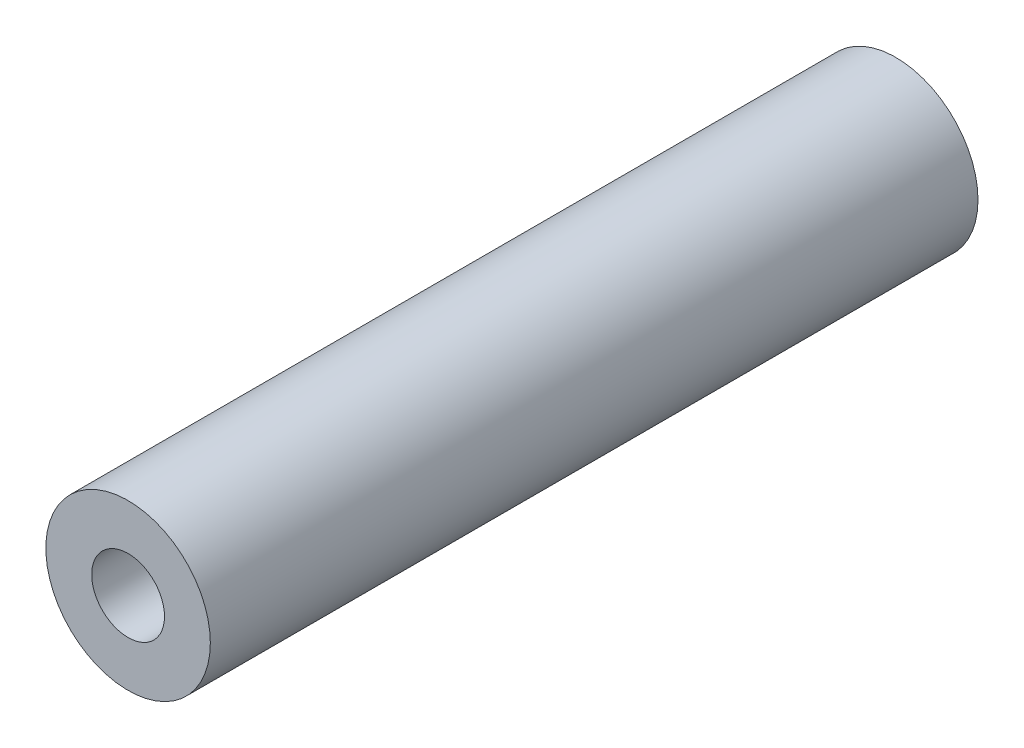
from build123d import *

# Parameters (mm, degrees)
SKETCH1_R      = 4.7625
SKETCH1_R_2    = 2.1082
EXTRUDE1_DEPTH = 22.225


with BuildPart() as part:
    # Sketch1 → Extrude1 (new, symmetric)
    with BuildSketch(Plane.XY):
        Circle(SKETCH1_R)
        Circle(SKETCH1_R_2, mode=Mode.SUBTRACT)
    extrude(amount=EXTRUDE1_DEPTH, both=True)


solid = part.part
